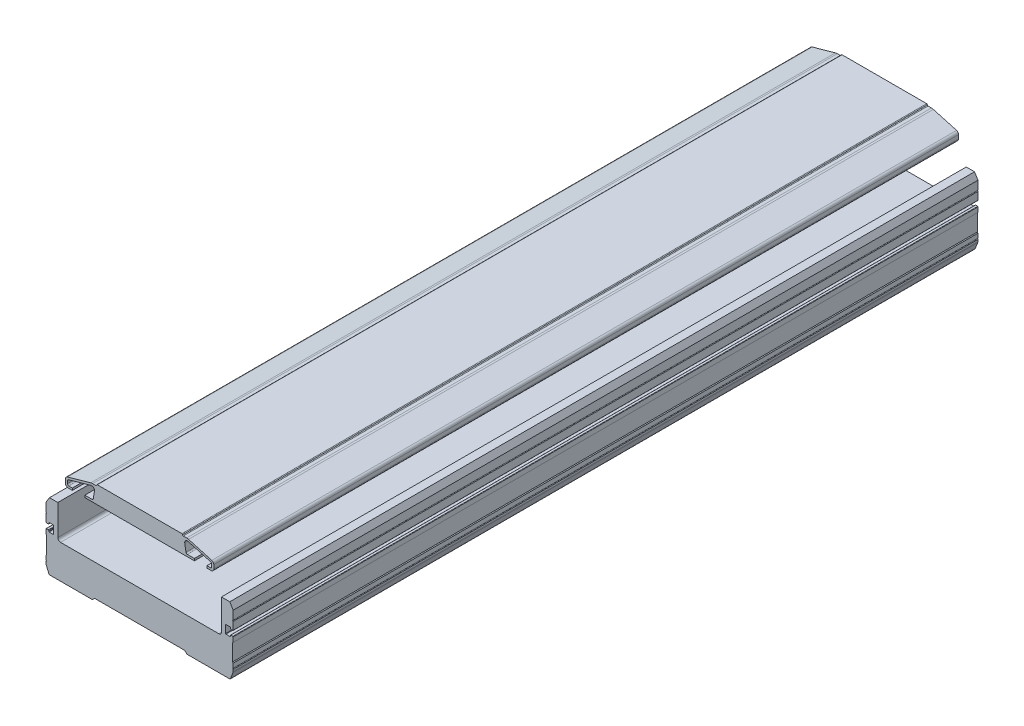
from build123d import *

# Parameters (mm, degrees)
EXTRUDE_1_DEPTH             = 537
EXTRUDE_1_2_DEPTH           = 537
HOLE_WIZARD_1_AT_2_COUNT    = 2
HOLE_WIZARD_1_AT_2_PITCH    = 106
HOLE_WIZARD_1_AT_3_COUNT    = 2
HOLE_WIZARD_1_AT_3_PITCH    = 226.353705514
HOLE_WIZARD_1_AT_4_COUNT    = 2
HOLE_WIZARD_1_AT_4_PITCH    = 200
HOLE_WIZARD_1_AT_5_COUNT    = 2
HOLE_WIZARD_1_AT_5_PITCH    = 413.806718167
HOLE_WIZARD_1_AT_6_COUNT    = 2
HOLE_WIZARD_1_AT_6_PITCH    = 400
HOLE_WIZARD_M6_0_AT_2_COUNT = 2
HOLE_WIZARD_M6_0_AT_2_PITCH = 106
HOLE_WIZARD_M6_0_AT_3_COUNT = 2
HOLE_WIZARD_M6_0_AT_3_PITCH = 200
HOLE_WIZARD_M6_0_AT_4_COUNT = 2
HOLE_WIZARD_M6_0_AT_4_PITCH = 226.353705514
HOLE_WIZARD_M6_0_AT_5_COUNT = 2
HOLE_WIZARD_M6_0_AT_5_PITCH = 413.806718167
HOLE_WIZARD_M6_0_AT_6_COUNT = 2
HOLE_WIZARD_M6_0_AT_6_PITCH = 400


with BuildPart() as part:
    # Sketch 1 → Extrude 1 (new body)
    with BuildSketch(Plane.XY):
        with BuildLine():
            Line((-39.5, 59.4), (39.5, 59.4))
            Line((39.5, 59.4), (39.5, 60.9))
            Line((39.5, 60.9), (34.4, 60.9))
            ThreePointArc((34.4, 60.9), (33.754110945, 61.136568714), (33.413816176, 61.734345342))
            Line((33.413816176, 61.734345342), (32.536146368, 66.959334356))
            ThreePointArc((32.536146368, 66.959334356), (33.171932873, 68.778444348), (35.048529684, 69.216359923))
            Line((35.048529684, 69.216359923), (51.270007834, 64.667479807))
            ThreePointArc((51.270007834, 64.667479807), (51.79687133, 64.308770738), (52, 63.704621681))
            Line((52, 63.704621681), (52, 61.9))
            ThreePointArc((52, 61.9), (51.707106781, 61.192893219), (51, 60.9))
            Line((51, 60.9), (48.5, 60.9))
            Line((48.5, 60.9), (48.5, 59.4))
            Line((48.5, 59.4), (51.5, 59.4))
            ThreePointArc((51.5, 59.4), (52.914213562, 59.985786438), (53.5, 61.4))
            Line((53.5, 61.4), (53.5, 64.083697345))
            ThreePointArc((53.5, 64.083697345), (53.093742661, 65.291995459), (52.040015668, 66.009413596))
            Line((52.040015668, 66.009413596), (35.262246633, 70.714290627))
            ThreePointArc((35.262246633, 70.714290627), (34.593583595, 70.853355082), (33.912207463, 70.9))
            Line((33.912207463, 70.9), (31.5, 70.9))
            ThreePointArc((31.5, 70.9), (31.146446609, 71.046446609), (31, 71.4))
            ThreePointArc((31, 71.4), (30.853553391, 71.753553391), (30.5, 71.9))
            Line((30.5, 71.9), (-30.5, 71.9))
            ThreePointArc((-30.5, 71.9), (-30.853553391, 71.753553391), (-31, 71.4))
            ThreePointArc((-31, 71.4), (-31.146446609, 71.046446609), (-31.5, 70.9))
            Line((-31.5, 70.9), (-33.912207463, 70.9))
            ThreePointArc((-33.912207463, 70.9), (-34.593583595, 70.853355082), (-35.262246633, 70.714290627))
            Line((-35.262246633, 70.714290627), (-52.040015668, 66.009413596))
            ThreePointArc((-52.040015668, 66.009413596), (-53.093742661, 65.291995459), (-53.5, 64.083697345))
            Line((-53.5, 64.083697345), (-53.5, 61.4))
            ThreePointArc((-53.5, 61.4), (-52.914213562, 59.985786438), (-51.5, 59.4))
            Line((-51.5, 59.4), (-48.5, 59.4))
            Line((-48.5, 59.4), (-48.5, 60.9))
            Line((-48.5, 60.9), (-51, 60.9))
            ThreePointArc((-51, 60.9), (-51.707106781, 61.192893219), (-52, 61.9))
            Line((-52, 61.9), (-52, 63.704621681))
            ThreePointArc((-52, 63.704621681), (-51.79687133, 64.308770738), (-51.270007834, 64.667479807))
            Line((-51.270007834, 64.667479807), (-35.048529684, 69.216359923))
            ThreePointArc((-35.048529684, 69.216359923), (-33.171932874, 68.778444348), (-32.536146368, 66.959334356))
            Line((-32.536146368, 66.959334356), (-33.413816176, 61.734345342))
            ThreePointArc((-33.413816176, 61.734345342), (-33.754110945, 61.136568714), (-34.4, 60.9))
            Line((-34.4, 60.9), (-39.5, 60.9))
            Line((-39.5, 60.9), (-39.5, 59.4))
        make_face()
    extrude(amount=-EXTRUDE_1_DEPTH)


with BuildPart() as body_2:
    # Sketch 1 → Extrude 1 2 (new body)
    with BuildSketch(Plane.XY):
        with BuildLine():
            Line((-67, 22), (-67, 10))
            Line((-67, 10), (-67.5, 9.5))
            Line((-67.5, 9.5), (-67.5, 6.375))
            ThreePointArc((-67.5, 6.375), (-67.125, 6), (-67.5, 5.625))
            Line((-67.5, 5.625), (-67.49999984, 4.381168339))
            ThreePointArc((-67.49999984, 4.381168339), (-67.464614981, 4.007418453), (-67.360006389, 3.646865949))
            Line((-67.360006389, 3.646865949), (-65.506419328, -1.028852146))
            ThreePointArc((-65.506419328, -1.028852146), (-65.35722349, -1.328991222), (-65.16, -1.6))
            Line((-65.16, -1.6), (-34.1, -1.6))
            Line((-34.1, -1.6), (-32.5, 0))
            Line((-32.5, 0), (32.5, 0))
            Line((32.5, 0), (34.1, -1.6))
            Line((34.1, -1.6), (65.16, -1.6))
            ThreePointArc((65.16, -1.6), (65.35722349, -1.328991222), (65.506419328, -1.028852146))
            Line((65.506419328, -1.028852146), (67.360006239, 3.646865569))
            ThreePointArc((67.360006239, 3.646865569), (67.464614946, 4.007418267), (67.499999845, 4.381168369))
            Line((67.499999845, 4.381168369), (67.499999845, 5.625000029))
            ThreePointArc((67.499999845, 5.625000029), (67.124999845, 6.000000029), (67.499999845, 6.375000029))
            Line((67.499999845, 6.375000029), (67.499999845, 9.500000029))
            Line((67.499999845, 9.500000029), (66.999999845, 10.000000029))
            Line((66.999999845, 10.000000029), (66.999999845, 22.000000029))
            Line((66.999999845, 22.000000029), (67.499999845, 22.500000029))
            Line((67.499999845, 22.500000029), (67.499999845, 25.900000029))
            ThreePointArc((67.499999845, 25.900000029), (67.41213188, 26.112132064), (67.199999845, 26.200000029))
            Line((67.199999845, 26.200000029), (65.799999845, 26.200000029))
            ThreePointArc((65.799999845, 26.200000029), (65.587867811, 26.112132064), (65.499999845, 25.900000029))
            Line((65.499999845, 25.900000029), (65.499999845, 25.300000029))
            ThreePointArc((65.499999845, 25.300000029), (65.41213188, 25.087867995), (65.199999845, 25.000000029))
            Line((65.199999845, 25.000000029), (62.299999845, 25.000000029))
            ThreePointArc((62.299999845, 25.000000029), (62.087867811, 25.087867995), (61.999999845, 25.300000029))
            Line((61.999999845, 25.300000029), (61.999999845, 30.700000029))
            ThreePointArc((61.999999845, 30.700000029), (62.087867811, 30.912132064), (62.299999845, 31.000000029))
            Line((62.299999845, 31.000000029), (65.199999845, 31.000000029))
            ThreePointArc((65.199999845, 31.000000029), (65.41213188, 30.912132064), (65.499999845, 30.700000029))
            Line((65.499999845, 30.700000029), (65.499999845, 30.100000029))
            ThreePointArc((65.499999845, 30.100000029), (65.587867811, 29.887867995), (65.799999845, 29.800000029))
            Line((65.799999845, 29.800000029), (67.199999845, 29.800000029))
            ThreePointArc((67.199999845, 29.800000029), (67.41213188, 29.887867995), (67.499999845, 30.100000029))
            Line((67.499999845, 30.100000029), (67.499999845, 35.625000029))
            ThreePointArc((67.499999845, 35.625000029), (67.124999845, 36.000000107), (67.5, 36.375000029))
            Line((67.5, 36.375000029), (67.5, 42.6))
            Line((67.5, 42.6), (65, 46.6))
            Line((65, 46.6), (59, 46.6))
            Line((59, 46.6), (59, 24.7))
            ThreePointArc((59, 24.7), (58.414213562, 23.285786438), (57, 22.7))
            Line((57, 22.7), (-57, 22.7))
            ThreePointArc((-57, 22.7), (-58.414213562, 23.285786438), (-59, 24.7))
            Line((-59, 24.7), (-59, 46.6))
            Line((-59, 46.6), (-65, 46.6))
            Line((-65, 46.6), (-67.5, 42.6))
            Line((-67.5, 42.6), (-67.5, 36.375))
            ThreePointArc((-67.5, 36.375), (-67.125, 36), (-67.5, 35.625))
            Line((-67.5, 35.625), (-67.5, 30.1))
            ThreePointArc((-67.5, 30.1), (-67.412132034, 29.887867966), (-67.2, 29.8))
            Line((-67.2, 29.8), (-65.8, 29.8))
            ThreePointArc((-65.8, 29.8), (-65.587867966, 29.887867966), (-65.5, 30.1))
            Line((-65.5, 30.1), (-65.5, 30.7))
            ThreePointArc((-65.5, 30.7), (-65.412132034, 30.912132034), (-65.2, 31))
            Line((-65.2, 31), (-62.3, 31))
            ThreePointArc((-62.3, 31), (-62.087867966, 30.912132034), (-62, 30.7))
            Line((-62, 30.7), (-62, 25.3))
            ThreePointArc((-62, 25.3), (-62.087867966, 25.087867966), (-62.3, 25))
            Line((-62.3, 25), (-65.2, 25))
            ThreePointArc((-65.2, 25), (-65.412132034, 25.087867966), (-65.5, 25.3))
            Line((-65.5, 25.3), (-65.5, 25.9))
            ThreePointArc((-65.5, 25.9), (-65.587867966, 26.112132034), (-65.8, 26.2))
            Line((-65.8, 26.2), (-67.2, 26.2))
            ThreePointArc((-67.2, 26.2), (-67.412132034, 26.112132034), (-67.5, 25.9))
            Line((-67.5, 25.9), (-67.5, 22.5))
            Line((-67.5, 22.5), (-67, 22))
        make_face()
    extrude(amount=-EXTRUDE_1_2_DEPTH)

    # Sketch 4 → Hole Wizard 1 (revolve, cut)
    with BuildSketch(Plane(origin=(-53, 46.6, -465.5), x_dir=(0, 0, 1), z_dir=(1, 0, 0))):
        Polygon((0, 0), (0, 48.2), (3.5, 48.2), (3.5, 41), (5.5, 41), (5.5, 0), align=None)
    hole_wizard_1 = revolve(axis=Axis((-53, 52.95, -465.5), (0, -1, 0)), mode=Mode.SUBTRACT)

    # Hole Wizard 1 at 2: Hole Wizard 1 ×2
    with Locations(*[(i * HOLE_WIZARD_1_AT_2_PITCH, 0, 0) for i in range(1, HOLE_WIZARD_1_AT_2_COUNT)]):
        add(hole_wizard_1, mode=Mode.SUBTRACT)

    # Hole Wizard 1 at 3: Hole Wizard 1 ×2
    with Locations(*[Vector(0.46829363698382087, 9.315616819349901e-14, 0.8835728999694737) * (i * HOLE_WIZARD_1_AT_3_PITCH) for i in range(1, HOLE_WIZARD_1_AT_3_COUNT)]):
        add(hole_wizard_1, mode=Mode.SUBTRACT)

    # Hole Wizard 1 at 4: Hole Wizard 1 ×2
    with Locations(*[(0, 0, i * HOLE_WIZARD_1_AT_4_PITCH) for i in range(1, HOLE_WIZARD_1_AT_4_COUNT)]):
        add(hole_wizard_1, mode=Mode.SUBTRACT)

    # Hole Wizard 1 at 5: Hole Wizard 1 ×2
    with Locations(*[Vector(0.2561582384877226, 5.0956746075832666e-14, 0.9666348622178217) * (i * HOLE_WIZARD_1_AT_5_PITCH) for i in range(1, HOLE_WIZARD_1_AT_5_COUNT)]):
        add(hole_wizard_1, mode=Mode.SUBTRACT)

    # Hole Wizard 1 at 6: Hole Wizard 1 ×2
    with Locations(*[(0, 0, i * HOLE_WIZARD_1_AT_6_PITCH) for i in range(1, HOLE_WIZARD_1_AT_6_COUNT)]):
        add(hole_wizard_1, mode=Mode.SUBTRACT)

    # Sketch 6 → Hole Wizard M6 _0 (revolve, cut)
    with BuildSketch(Plane(origin=(-53, -1.6, -475.5), x_dir=(0, 0, -1), z_dir=(1, 0, 0))):
        Polygon((0, 0), (0, 16.502151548), (2.5, 15), (2.5, 0), align=None)
    hole_wizard_m6_0 = revolve(axis=Axis((-53, -7.95, -475.5), (0, 1, 0)), mode=Mode.SUBTRACT)

    # Hole Wizard M6 _0 at 2: Hole Wizard M6 _0 ×2
    with Locations(*[(i * HOLE_WIZARD_M6_0_AT_2_PITCH, 0, 0) for i in range(1, HOLE_WIZARD_M6_0_AT_2_COUNT)]):
        add(hole_wizard_m6_0, mode=Mode.SUBTRACT)

    # Hole Wizard M6 _0 at 3: Hole Wizard M6 _0 ×2
    with Locations(*[(0, 0, i * HOLE_WIZARD_M6_0_AT_3_PITCH) for i in range(1, HOLE_WIZARD_M6_0_AT_3_COUNT)]):
        add(hole_wizard_m6_0, mode=Mode.SUBTRACT)

    # Hole Wizard M6 _0 at 4: Hole Wizard M6 _0 ×2
    with Locations(*[Vector(0.46829363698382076, 0, 0.8835728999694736) * (i * HOLE_WIZARD_M6_0_AT_4_PITCH) for i in range(1, HOLE_WIZARD_M6_0_AT_4_COUNT)]):
        add(hole_wizard_m6_0, mode=Mode.SUBTRACT)

    # Hole Wizard M6 _0 at 5: Hole Wizard M6 _0 ×2
    with Locations(*[Vector(0.2561582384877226, 0, 0.9666348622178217) * (i * HOLE_WIZARD_M6_0_AT_5_PITCH) for i in range(1, HOLE_WIZARD_M6_0_AT_5_COUNT)]):
        add(hole_wizard_m6_0, mode=Mode.SUBTRACT)

    # Hole Wizard M6 _0 at 6: Hole Wizard M6 _0 ×2
    with Locations(*[(0, 0, i * HOLE_WIZARD_M6_0_AT_6_PITCH) for i in range(1, HOLE_WIZARD_M6_0_AT_6_COUNT)]):
        add(hole_wizard_m6_0, mode=Mode.SUBTRACT)


solid = Compound([part.part, body_2.part])
